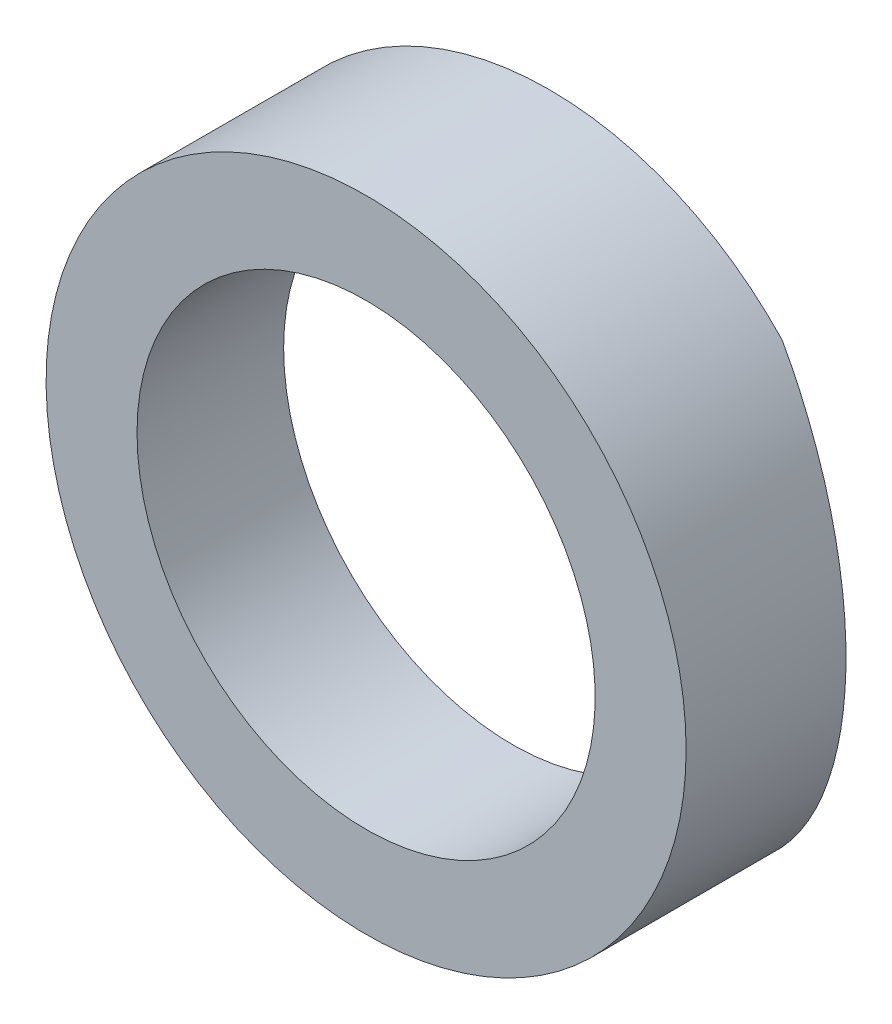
ISO-10303-21;
HEADER;
FILE_DESCRIPTION(('STEP AP214'),'2;1');
FILE_NAME('part.step','',(''),(''),'','','');
FILE_SCHEMA(('AUTOMOTIVE_DESIGN { 1 0 10303 214 1 1 1 1 }'));
ENDSEC;
DATA;
#1=APPLICATION_CONTEXT('core data for automotive mechanical design processes');
#2=APPLICATION_PROTOCOL_DEFINITION('international standard','automotive_design',2000,#1);
#3=PRODUCT_CONTEXT('',#1,'mechanical');
#4=PRODUCT('Part','Part','',(#3));
#5=PRODUCT_RELATED_PRODUCT_CATEGORY('part','',(#4));
#6=PRODUCT_DEFINITION_FORMATION('','',#4);
#7=PRODUCT_DEFINITION_CONTEXT('part definition',#1,'design');
#8=PRODUCT_DEFINITION('design','',#6,#7);
#9=PRODUCT_DEFINITION_SHAPE('','',#8);
#10=(LENGTH_UNIT() NAMED_UNIT(*) SI_UNIT(.MILLI.,.METRE.));
#11=(NAMED_UNIT(*) PLANE_ANGLE_UNIT() SI_UNIT($,.RADIAN.));
#12=(NAMED_UNIT(*) SI_UNIT($,.STERADIAN.) SOLID_ANGLE_UNIT());
#13=UNCERTAINTY_MEASURE_WITH_UNIT(LENGTH_MEASURE(1.E-05),#10,'distance_accuracy_value','');
#14=(GEOMETRIC_REPRESENTATION_CONTEXT(3) GLOBAL_UNCERTAINTY_ASSIGNED_CONTEXT((#13)) GLOBAL_UNIT_ASSIGNED_CONTEXT((#10,
#11,#12)) REPRESENTATION_CONTEXT('',''));
#15=CARTESIAN_POINT('',(0.,0.,0.));
#16=DIRECTION('',(0.,0.,1.));
#17=DIRECTION('',(1.,0.,0.));
#18=AXIS2_PLACEMENT_3D('',#15,#16,#17);
#19=CARTESIAN_POINT('',(0.,0.,0.));
#20=DIRECTION('',(0.,0.,1.));
#21=DIRECTION('',(1.,0.,0.));
#22=AXIS2_PLACEMENT_3D('',#19,#20,#21);
#23=PLANE('',#22);
#24=CARTESIAN_POINT('',(0.,0.,0.));
#25=DIRECTION('',(0.,0.,1.));
#26=DIRECTION('',(1.,0.,0.));
#27=AXIS2_PLACEMENT_3D('',#24,#25,#26);
#28=CIRCLE('',#27,34.925);
#29=CARTESIAN_POINT('',(25.4,23.9707243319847,-1.11022302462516E-13));
#30=VERTEX_POINT('',#29);
#31=CARTESIAN_POINT('',(-25.4,23.9707243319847,0.));
#32=VERTEX_POINT('',#31);
#33=EDGE_CURVE('E95',#30,#32,#28,.T.);
#34=ORIENTED_EDGE('',*,*,#33,.F.);
#35=DIRECTION('',(0.,1.,0.));
#36=VECTOR('',#35,1.);
#37=CARTESIAN_POINT('',(25.4,-34.9249999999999,0.));
#38=LINE('',#37,#36);
#39=CARTESIAN_POINT('',(25.4,19.05,0.));
#40=VERTEX_POINT('',#39);
#41=EDGE_CURVE('E79',#40,#30,#38,.T.);
#42=ORIENTED_EDGE('',*,*,#41,.F.);
#43=CARTESIAN_POINT('',(0.,0.,0.));
#44=DIRECTION('',(0.,0.,-1.));
#45=DIRECTION('',(-1.,0.,0.));
#46=AXIS2_PLACEMENT_3D('',#43,#44,#45);
#47=CIRCLE('',#46,31.75);
#48=CARTESIAN_POINT('',(-25.4,19.05,1.11022302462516E-13));
#49=VERTEX_POINT('',#48);
#50=EDGE_CURVE('E109',#49,#40,#47,.T.);
#51=ORIENTED_EDGE('',*,*,#50,.F.);
#52=DIRECTION('',(0.,1.,0.));
#53=VECTOR('',#52,1.);
#54=CARTESIAN_POINT('',(-25.4,-34.9249999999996,0.));
#55=LINE('',#54,#53);
#56=EDGE_CURVE('E58',#49,#32,#55,.T.);
#57=ORIENTED_EDGE('',*,*,#56,.T.);
#58=EDGE_LOOP('',(#34,#42,#51,#57));
#59=FACE_BOUND('',#58,.T.);
#60=ADVANCED_FACE('F36',(#59),#23,.F.);
#61=CARTESIAN_POINT('',(0.,2.22044604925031E-13,20.));
#62=DIRECTION('',(0.,0.,-1.));
#63=DIRECTION('',(-1.,0.,0.));
#64=AXIS2_PLACEMENT_3D('',#61,#62,#63);
#65=CYLINDRICAL_SURFACE('',#64,25.);
#66=CARTESIAN_POINT('',(0.,2.22044604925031E-13,20.));
#67=DIRECTION('',(0.,0.,-1.));
#68=DIRECTION('',(-1.,0.,0.));
#69=AXIS2_PLACEMENT_3D('',#66,#67,#68);
#70=CIRCLE('',#69,25.);
#71=CARTESIAN_POINT('',(-25.0000000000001,2.22044604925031E-13,20.));
#72=VERTEX_POINT('',#71);
#73=EDGE_CURVE('E99',#72,#72,#70,.T.);
#74=ORIENTED_EDGE('',*,*,#73,.F.);
#75=EDGE_LOOP('',(#74));
#76=FACE_BOUND('',#75,.T.);
#77=CARTESIAN_POINT('',(0.,2.22044604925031E-13,4.));
#78=DIRECTION('',(0.,0.,-1.));
#79=DIRECTION('',(-1.,0.,0.));
#80=AXIS2_PLACEMENT_3D('',#77,#78,#79);
#81=CIRCLE('',#80,25.);
#82=CARTESIAN_POINT('',(-25.,2.22044604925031E-13,4.));
#83=VERTEX_POINT('',#82);
#84=EDGE_CURVE('E102',#83,#83,#81,.F.);
#85=ORIENTED_EDGE('',*,*,#84,.F.);
#86=EDGE_LOOP('',(#85));
#87=FACE_BOUND('',#86,.T.);
#88=ADVANCED_FACE('F121',(#76,#87),#65,.F.);
#89=CARTESIAN_POINT('',(0.,2.22044604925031E-13,20.));
#90=DIRECTION('',(0.,0.,-1.));
#91=DIRECTION('',(-1.,0.,0.));
#92=AXIS2_PLACEMENT_3D('',#89,#90,#91);
#93=CYLINDRICAL_SURFACE('',#92,34.925);
#94=CARTESIAN_POINT('',(0.,2.22044604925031E-13,20.));
#95=DIRECTION('',(0.,0.,1.));
#96=DIRECTION('',(1.,0.,0.));
#97=AXIS2_PLACEMENT_3D('',#94,#95,#96);
#98=CIRCLE('',#97,34.925);
#99=CARTESIAN_POINT('',(34.9249999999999,2.22044604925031E-13,20.));
#100=VERTEX_POINT('',#99);
#101=EDGE_CURVE('E94',#100,#100,#98,.T.);
#102=ORIENTED_EDGE('',*,*,#101,.F.);
#103=EDGE_LOOP('',(#102));
#104=FACE_BOUND('',#103,.T.);
#105=CARTESIAN_POINT('',(-25.4,-23.9707243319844,0.));
#106=VERTEX_POINT('',#105);
#107=CARTESIAN_POINT('',(25.4,-23.9707243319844,-1.11022302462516E-13));
#108=VERTEX_POINT('',#107);
#109=EDGE_CURVE('E89',#106,#108,#28,.T.);
#110=ORIENTED_EDGE('',*,*,#109,.T.);
#111=CARTESIAN_POINT('',(0.,0.,-6.80590948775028));
#112=DIRECTION('',(-0.258819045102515,0.,0.96592582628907));
#113=DIRECTION('',(-0.96592582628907,0.,-0.258819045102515));
#114=AXIS2_PLACEMENT_3D('',#111,#112,#113);
#115=ELLIPSE('',#114,36.1570206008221,34.925);
#116=EDGE_CURVE('E76',#108,#30,#115,.T.);
#117=ORIENTED_EDGE('',*,*,#116,.T.);
#118=ORIENTED_EDGE('',*,*,#33,.T.);
#119=CARTESIAN_POINT('',(0.,0.,-6.80590948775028));
#120=DIRECTION('',(0.258819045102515,0.,0.96592582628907));
#121=DIRECTION('',(0.96592582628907,0.,-0.258819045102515));
#122=AXIS2_PLACEMENT_3D('',#119,#120,#121);
#123=ELLIPSE('',#122,36.1570206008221,34.925);
#124=EDGE_CURVE('E93',#32,#106,#123,.T.);
#125=ORIENTED_EDGE('',*,*,#124,.T.);
#126=EDGE_LOOP('',(#110,#117,#118,#125));
#127=FACE_BOUND('',#126,.T.);
#128=ADVANCED_FACE('F38',(#104,#127),#93,.T.);
#129=CARTESIAN_POINT('',(0.,2.22044604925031E-13,20.));
#130=DIRECTION('',(0.,0.,1.));
#131=DIRECTION('',(1.,0.,0.));
#132=AXIS2_PLACEMENT_3D('',#129,#130,#131);
#133=PLANE('',#132);
#134=ORIENTED_EDGE('',*,*,#73,.T.);
#135=EDGE_LOOP('',(#134));
#136=FACE_BOUND('',#135,.T.);
#137=ORIENTED_EDGE('',*,*,#101,.T.);
#138=EDGE_LOOP('',(#137));
#139=FACE_BOUND('',#138,.T.);
#140=ADVANCED_FACE('F118',(#136,#139),#133,.T.);
#141=CARTESIAN_POINT('',(25.4,-19.05,-1.11022302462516E-13));
#142=VERTEX_POINT('',#141);
#143=CARTESIAN_POINT('',(-25.4,-19.0499999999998,-1.11022302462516E-13));
#144=VERTEX_POINT('',#143);
#145=EDGE_CURVE('E90',#142,#144,#47,.T.);
#146=ORIENTED_EDGE('',*,*,#145,.F.);
#147=EDGE_CURVE('E51',#108,#142,#38,.T.);
#148=ORIENTED_EDGE('',*,*,#147,.F.);
#149=ORIENTED_EDGE('',*,*,#109,.F.);
#150=EDGE_CURVE('E202',#106,#144,#55,.T.);
#151=ORIENTED_EDGE('',*,*,#150,.T.);
#152=EDGE_LOOP('',(#146,#148,#149,#151));
#153=FACE_BOUND('',#152,.T.);
#154=ADVANCED_FACE('F87',(#153),#23,.F.);
#155=CARTESIAN_POINT('',(0.,2.22044604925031E-13,4.));
#156=DIRECTION('',(0.,0.,-1.));
#157=DIRECTION('',(-1.,0.,0.));
#158=AXIS2_PLACEMENT_3D('',#155,#156,#157);
#159=PLANE('',#158);
#160=CARTESIAN_POINT('',(0.,2.22044604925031E-13,4.));
#161=DIRECTION('',(0.,0.,-1.));
#162=DIRECTION('',(-1.,0.,0.));
#163=AXIS2_PLACEMENT_3D('',#160,#161,#162);
#164=CIRCLE('',#163,31.75);
#165=CARTESIAN_POINT('',(-31.75,2.22044604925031E-13,4.));
#166=VERTEX_POINT('',#165);
#167=EDGE_CURVE('E104',#166,#166,#164,.T.);
#168=ORIENTED_EDGE('',*,*,#167,.T.);
#169=EDGE_LOOP('',(#168));
#170=FACE_BOUND('',#169,.T.);
#171=ORIENTED_EDGE('',*,*,#84,.T.);
#172=EDGE_LOOP('',(#171));
#173=FACE_BOUND('',#172,.T.);
#174=ADVANCED_FACE('F127',(#170,#173),#159,.T.);
#175=CARTESIAN_POINT('',(0.,2.22044604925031E-13,4.));
#176=DIRECTION('',(0.,0.,-1.));
#177=DIRECTION('',(-1.,0.,0.));
#178=AXIS2_PLACEMENT_3D('',#175,#176,#177);
#179=CYLINDRICAL_SURFACE('',#178,31.75);
#180=ORIENTED_EDGE('',*,*,#167,.F.);
#181=EDGE_LOOP('',(#180));
#182=FACE_BOUND('',#181,.T.);
#183=ORIENTED_EDGE('',*,*,#50,.T.);
#184=CARTESIAN_POINT('',(0.,0.,-6.80590948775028));
#185=DIRECTION('',(-0.258819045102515,0.,0.96592582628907));
#186=DIRECTION('',(-0.96592582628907,0.,-0.258819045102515));
#187=AXIS2_PLACEMENT_3D('',#184,#185,#186);
#188=ELLIPSE('',#187,32.8700187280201,31.75);
#189=EDGE_CURVE('E11',#40,#142,#188,.F.);
#190=ORIENTED_EDGE('',*,*,#189,.T.);
#191=ORIENTED_EDGE('',*,*,#145,.T.);
#192=CARTESIAN_POINT('',(0.,0.,-6.80590948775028));
#193=DIRECTION('',(0.258819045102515,0.,0.96592582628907));
#194=DIRECTION('',(0.96592582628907,0.,-0.258819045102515));
#195=AXIS2_PLACEMENT_3D('',#192,#193,#194);
#196=ELLIPSE('',#195,32.8700187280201,31.75);
#197=EDGE_CURVE('E44',#144,#49,#196,.F.);
#198=ORIENTED_EDGE('',*,*,#197,.T.);
#199=EDGE_LOOP('',(#183,#190,#191,#198));
#200=FACE_BOUND('',#199,.T.);
#201=ADVANCED_FACE('F108',(#182,#200),#179,.F.);
#202=CARTESIAN_POINT('',(-54.6722579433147,-34.9249999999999,7.84347787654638));
#203=DIRECTION('',(0.258819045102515,0.,0.96592582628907));
#204=DIRECTION('',(0.96592582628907,0.,-0.258819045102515));
#205=AXIS2_PLACEMENT_3D('',#202,#203,#204);
#206=PLANE('',#205);
#207=ORIENTED_EDGE('',*,*,#56,.F.);
#208=ORIENTED_EDGE('',*,*,#197,.F.);
#209=ORIENTED_EDGE('',*,*,#150,.F.);
#210=ORIENTED_EDGE('',*,*,#124,.F.);
#211=EDGE_LOOP('',(#207,#208,#209,#210));
#212=FACE_BOUND('',#211,.T.);
#213=ADVANCED_FACE('F135',(#212),#206,.F.);
#214=CARTESIAN_POINT('',(54.6722579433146,-34.9249999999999,7.84347787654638));
#215=DIRECTION('',(-0.258819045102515,0.,0.96592582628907));
#216=DIRECTION('',(0.96592582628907,0.,0.258819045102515));
#217=AXIS2_PLACEMENT_3D('',#214,#215,#216);
#218=PLANE('',#217);
#219=ORIENTED_EDGE('',*,*,#147,.T.);
#220=ORIENTED_EDGE('',*,*,#189,.F.);
#221=ORIENTED_EDGE('',*,*,#41,.T.);
#222=ORIENTED_EDGE('',*,*,#116,.F.);
#223=EDGE_LOOP('',(#219,#220,#221,#222));
#224=FACE_BOUND('',#223,.T.);
#225=ADVANCED_FACE('F77',(#224),#218,.F.);
#226=CLOSED_SHELL('',(#60,#88,#128,#140,#154,#174,#201,#213,#225));
#227=MANIFOLD_SOLID_BREP('B2',#226);
#228=ADVANCED_BREP_SHAPE_REPRESENTATION('',(#18,#227),#14);
#229=SHAPE_DEFINITION_REPRESENTATION(#9,#228);
ENDSEC;
END-ISO-10303-21;
